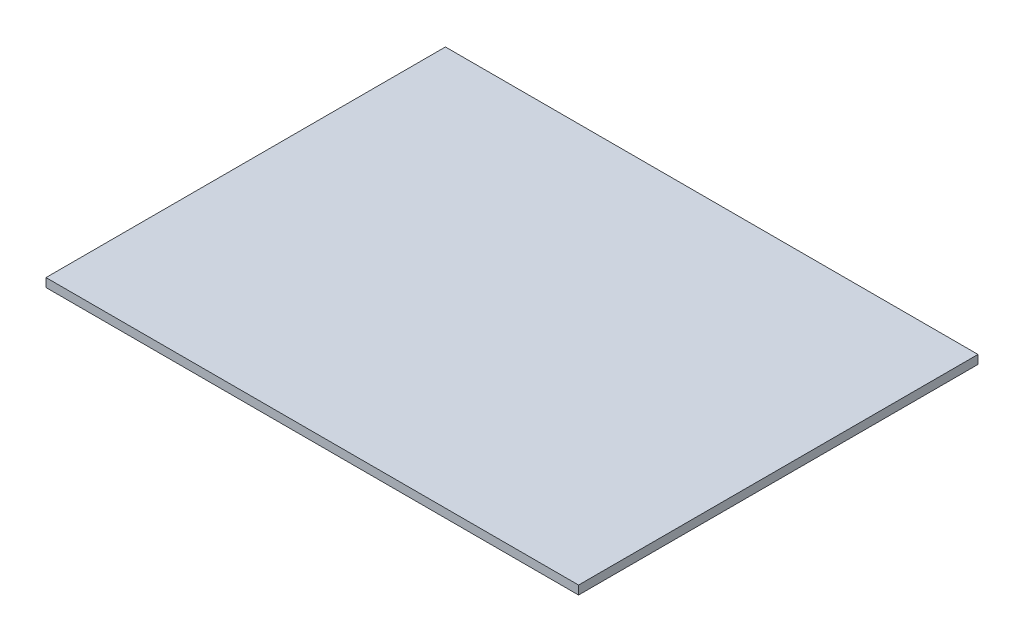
ISO-10303-21;
HEADER;
FILE_DESCRIPTION(('STEP AP214'),'2;1');
FILE_NAME('part.step','',(''),(''),'','','');
FILE_SCHEMA(('AUTOMOTIVE_DESIGN { 1 0 10303 214 1 1 1 1 }'));
ENDSEC;
DATA;
#1=APPLICATION_CONTEXT('core data for automotive mechanical design processes');
#2=APPLICATION_PROTOCOL_DEFINITION('international standard','automotive_design',2000,#1);
#3=PRODUCT_CONTEXT('',#1,'mechanical');
#4=PRODUCT('Part','Part','',(#3));
#5=PRODUCT_RELATED_PRODUCT_CATEGORY('part','',(#4));
#6=PRODUCT_DEFINITION_FORMATION('','',#4);
#7=PRODUCT_DEFINITION_CONTEXT('part definition',#1,'design');
#8=PRODUCT_DEFINITION('design','',#6,#7);
#9=PRODUCT_DEFINITION_SHAPE('','',#8);
#10=(LENGTH_UNIT() NAMED_UNIT(*) SI_UNIT(.MILLI.,.METRE.));
#11=(NAMED_UNIT(*) PLANE_ANGLE_UNIT() SI_UNIT($,.RADIAN.));
#12=(NAMED_UNIT(*) SI_UNIT($,.STERADIAN.) SOLID_ANGLE_UNIT());
#13=UNCERTAINTY_MEASURE_WITH_UNIT(LENGTH_MEASURE(1.E-05),#10,'distance_accuracy_value','');
#14=(GEOMETRIC_REPRESENTATION_CONTEXT(3) GLOBAL_UNCERTAINTY_ASSIGNED_CONTEXT((#13)) GLOBAL_UNIT_ASSIGNED_CONTEXT((#10,
#11,#12)) REPRESENTATION_CONTEXT('',''));
#15=CARTESIAN_POINT('',(0.,0.,0.));
#16=DIRECTION('',(0.,0.,1.));
#17=DIRECTION('',(1.,0.,0.));
#18=AXIS2_PLACEMENT_3D('',#15,#16,#17);
#19=CARTESIAN_POINT('',(584.2,19.05,-438.15));
#20=DIRECTION('',(-1.,0.,0.));
#21=DIRECTION('',(0.,0.,1.));
#22=AXIS2_PLACEMENT_3D('',#19,#20,#21);
#23=PLANE('',#22);
#24=DIRECTION('',(0.,0.,-1.));
#25=VECTOR('',#24,1.);
#26=CARTESIAN_POINT('',(584.2,0.,-438.15));
#27=LINE('',#26,#25);
#28=CARTESIAN_POINT('',(584.2,0.,438.15));
#29=VERTEX_POINT('',#28);
#30=CARTESIAN_POINT('',(584.2,0.,-438.15));
#31=VERTEX_POINT('',#30);
#32=EDGE_CURVE('E102',#29,#31,#27,.T.);
#33=ORIENTED_EDGE('',*,*,#32,.T.);
#34=DIRECTION('',(0.,-1.,0.));
#35=VECTOR('',#34,1.);
#36=CARTESIAN_POINT('',(584.2,19.05,-438.15));
#37=LINE('',#36,#35);
#38=CARTESIAN_POINT('',(584.2,19.05,-438.15));
#39=VERTEX_POINT('',#38);
#40=EDGE_CURVE('E11',#39,#31,#37,.T.);
#41=ORIENTED_EDGE('',*,*,#40,.F.);
#42=DIRECTION('',(0.,0.,-1.));
#43=VECTOR('',#42,1.);
#44=CARTESIAN_POINT('',(584.2,19.05,-438.15));
#45=LINE('',#44,#43);
#46=CARTESIAN_POINT('',(584.2,19.05,438.15));
#47=VERTEX_POINT('',#46);
#48=EDGE_CURVE('E90',#47,#39,#45,.T.);
#49=ORIENTED_EDGE('',*,*,#48,.F.);
#50=DIRECTION('',(0.,-1.,0.));
#51=VECTOR('',#50,1.);
#52=CARTESIAN_POINT('',(584.2,19.05,438.15));
#53=LINE('',#52,#51);
#54=EDGE_CURVE('E98',#47,#29,#53,.T.);
#55=ORIENTED_EDGE('',*,*,#54,.T.);
#56=EDGE_LOOP('',(#33,#41,#49,#55));
#57=FACE_BOUND('',#56,.T.);
#58=ADVANCED_FACE('F39',(#57),#23,.F.);
#59=CARTESIAN_POINT('',(-584.2,19.05,-438.15));
#60=DIRECTION('',(0.,0.,1.));
#61=DIRECTION('',(1.,0.,0.));
#62=AXIS2_PLACEMENT_3D('',#59,#60,#61);
#63=PLANE('',#62);
#64=DIRECTION('',(-1.,0.,0.));
#65=VECTOR('',#64,1.);
#66=CARTESIAN_POINT('',(-584.2,0.,-438.15));
#67=LINE('',#66,#65);
#68=CARTESIAN_POINT('',(-584.2,0.,-438.15));
#69=VERTEX_POINT('',#68);
#70=EDGE_CURVE('E94',#31,#69,#67,.T.);
#71=ORIENTED_EDGE('',*,*,#70,.T.);
#72=DIRECTION('',(0.,-1.,0.));
#73=VECTOR('',#72,1.);
#74=CARTESIAN_POINT('',(-584.2,19.05,-438.15));
#75=LINE('',#74,#73);
#76=CARTESIAN_POINT('',(-584.2,19.05,-438.15));
#77=VERTEX_POINT('',#76);
#78=EDGE_CURVE('E47',#77,#69,#75,.T.);
#79=ORIENTED_EDGE('',*,*,#78,.F.);
#80=DIRECTION('',(-1.,0.,0.));
#81=VECTOR('',#80,1.);
#82=CARTESIAN_POINT('',(-584.2,19.05,-438.15));
#83=LINE('',#82,#81);
#84=EDGE_CURVE('E85',#39,#77,#83,.T.);
#85=ORIENTED_EDGE('',*,*,#84,.F.);
#86=ORIENTED_EDGE('',*,*,#40,.T.);
#87=EDGE_LOOP('',(#71,#79,#85,#86));
#88=FACE_BOUND('',#87,.T.);
#89=ADVANCED_FACE('F93',(#88),#63,.F.);
#90=CARTESIAN_POINT('',(-584.2,19.05,-438.15));
#91=DIRECTION('',(1.,0.,0.));
#92=DIRECTION('',(0.,0.,-1.));
#93=AXIS2_PLACEMENT_3D('',#90,#91,#92);
#94=PLANE('',#93);
#95=DIRECTION('',(0.,0.,1.));
#96=VECTOR('',#95,1.);
#97=CARTESIAN_POINT('',(-584.2,0.,-438.15));
#98=LINE('',#97,#96);
#99=CARTESIAN_POINT('',(-584.2,0.,438.15));
#100=VERTEX_POINT('',#99);
#101=EDGE_CURVE('E72',#69,#100,#98,.T.);
#102=ORIENTED_EDGE('',*,*,#101,.T.);
#103=DIRECTION('',(0.,-1.,0.));
#104=VECTOR('',#103,1.);
#105=CARTESIAN_POINT('',(-584.2,19.05,438.15));
#106=LINE('',#105,#104);
#107=CARTESIAN_POINT('',(-584.2,19.05,438.15));
#108=VERTEX_POINT('',#107);
#109=EDGE_CURVE('E95',#108,#100,#106,.T.);
#110=ORIENTED_EDGE('',*,*,#109,.F.);
#111=DIRECTION('',(0.,0.,1.));
#112=VECTOR('',#111,1.);
#113=CARTESIAN_POINT('',(-584.2,19.05,-438.15));
#114=LINE('',#113,#112);
#115=EDGE_CURVE('E88',#77,#108,#114,.T.);
#116=ORIENTED_EDGE('',*,*,#115,.F.);
#117=ORIENTED_EDGE('',*,*,#78,.T.);
#118=EDGE_LOOP('',(#102,#110,#116,#117));
#119=FACE_BOUND('',#118,.T.);
#120=ADVANCED_FACE('F96',(#119),#94,.F.);
#121=CARTESIAN_POINT('',(-584.2,19.05,438.15));
#122=DIRECTION('',(0.,0.,-1.));
#123=DIRECTION('',(-1.,0.,0.));
#124=AXIS2_PLACEMENT_3D('',#121,#122,#123);
#125=PLANE('',#124);
#126=DIRECTION('',(1.,0.,0.));
#127=VECTOR('',#126,1.);
#128=CARTESIAN_POINT('',(-584.2,0.,438.15));
#129=LINE('',#128,#127);
#130=EDGE_CURVE('E78',#100,#29,#129,.T.);
#131=ORIENTED_EDGE('',*,*,#130,.T.);
#132=ORIENTED_EDGE('',*,*,#54,.F.);
#133=DIRECTION('',(1.,0.,0.));
#134=VECTOR('',#133,1.);
#135=CARTESIAN_POINT('',(-584.2,19.05,438.15));
#136=LINE('',#135,#134);
#137=EDGE_CURVE('E55',#108,#47,#136,.T.);
#138=ORIENTED_EDGE('',*,*,#137,.F.);
#139=ORIENTED_EDGE('',*,*,#109,.T.);
#140=EDGE_LOOP('',(#131,#132,#138,#139));
#141=FACE_BOUND('',#140,.T.);
#142=ADVANCED_FACE('F109',(#141),#125,.F.);
#143=CARTESIAN_POINT('',(0.,19.05,0.));
#144=DIRECTION('',(0.,1.,0.));
#145=DIRECTION('',(0.,0.,1.));
#146=AXIS2_PLACEMENT_3D('',#143,#144,#145);
#147=PLANE('',#146);
#148=ORIENTED_EDGE('',*,*,#48,.T.);
#149=ORIENTED_EDGE('',*,*,#84,.T.);
#150=ORIENTED_EDGE('',*,*,#115,.T.);
#151=ORIENTED_EDGE('',*,*,#137,.T.);
#152=EDGE_LOOP('',(#148,#149,#150,#151));
#153=FACE_BOUND('',#152,.T.);
#154=ADVANCED_FACE('F86',(#153),#147,.T.);
#155=CARTESIAN_POINT('',(0.,0.,0.));
#156=DIRECTION('',(0.,1.,0.));
#157=DIRECTION('',(0.,0.,1.));
#158=AXIS2_PLACEMENT_3D('',#155,#156,#157);
#159=PLANE('',#158);
#160=ORIENTED_EDGE('',*,*,#32,.F.);
#161=ORIENTED_EDGE('',*,*,#130,.F.);
#162=ORIENTED_EDGE('',*,*,#101,.F.);
#163=ORIENTED_EDGE('',*,*,#70,.F.);
#164=EDGE_LOOP('',(#160,#161,#162,#163));
#165=FACE_BOUND('',#164,.T.);
#166=ADVANCED_FACE('F112',(#165),#159,.F.);
#167=CLOSED_SHELL('',(#58,#89,#120,#142,#154,#166));
#168=MANIFOLD_SOLID_BREP('B2',#167);
#169=ADVANCED_BREP_SHAPE_REPRESENTATION('',(#18,#168),#14);
#170=SHAPE_DEFINITION_REPRESENTATION(#9,#169);
ENDSEC;
END-ISO-10303-21;
